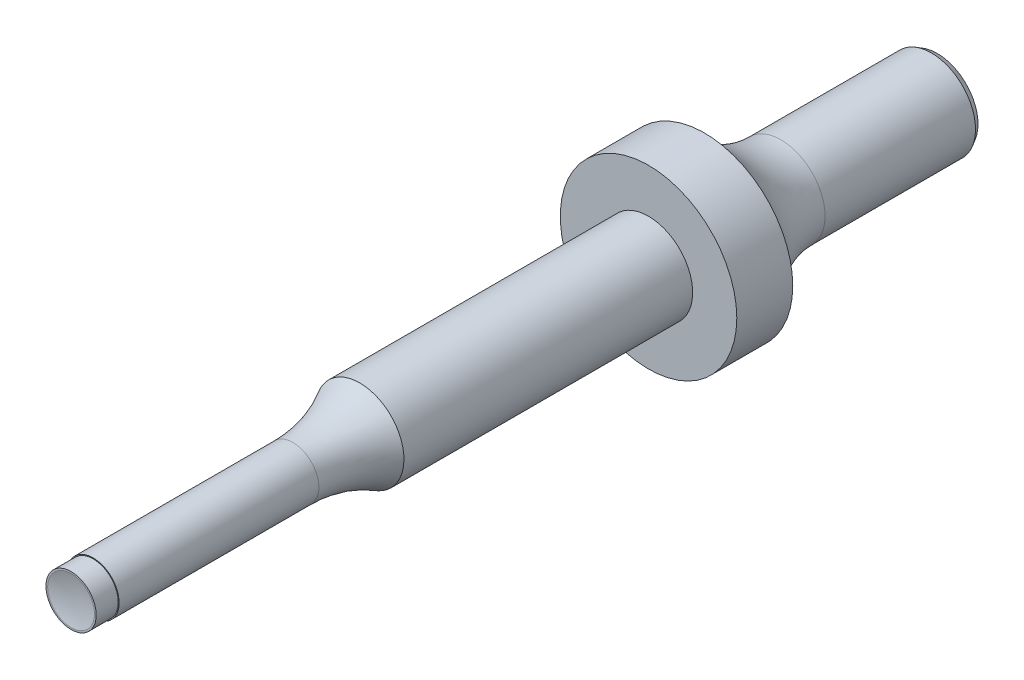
ISO-10303-21;
HEADER;
FILE_DESCRIPTION(('STEP AP214'),'2;1');
FILE_NAME('part.step','',(''),(''),'','','');
FILE_SCHEMA(('AUTOMOTIVE_DESIGN { 1 0 10303 214 1 1 1 1 }'));
ENDSEC;
DATA;
#1=APPLICATION_CONTEXT('core data for automotive mechanical design processes');
#2=APPLICATION_PROTOCOL_DEFINITION('international standard','automotive_design',2000,#1);
#3=PRODUCT_CONTEXT('',#1,'mechanical');
#4=PRODUCT('Part','Part','',(#3));
#5=PRODUCT_RELATED_PRODUCT_CATEGORY('part','',(#4));
#6=PRODUCT_DEFINITION_FORMATION('','',#4);
#7=PRODUCT_DEFINITION_CONTEXT('part definition',#1,'design');
#8=PRODUCT_DEFINITION('design','',#6,#7);
#9=PRODUCT_DEFINITION_SHAPE('','',#8);
#10=(LENGTH_UNIT() NAMED_UNIT(*) SI_UNIT(.MILLI.,.METRE.));
#11=(NAMED_UNIT(*) PLANE_ANGLE_UNIT() SI_UNIT($,.RADIAN.));
#12=(NAMED_UNIT(*) SI_UNIT($,.STERADIAN.) SOLID_ANGLE_UNIT());
#13=UNCERTAINTY_MEASURE_WITH_UNIT(LENGTH_MEASURE(1.E-05),#10,'distance_accuracy_value','');
#14=(GEOMETRIC_REPRESENTATION_CONTEXT(3) GLOBAL_UNCERTAINTY_ASSIGNED_CONTEXT((#13)) GLOBAL_UNIT_ASSIGNED_CONTEXT((#10,
#11,#12)) REPRESENTATION_CONTEXT('',''));
#15=CARTESIAN_POINT('',(0.,0.,0.));
#16=DIRECTION('',(0.,0.,1.));
#17=DIRECTION('',(1.,0.,0.));
#18=AXIS2_PLACEMENT_3D('',#15,#16,#17);
#19=CARTESIAN_POINT('',(0.,0.,-100.));
#20=DIRECTION('',(0.,0.,1.));
#21=DIRECTION('',(1.,0.,0.));
#22=AXIS2_PLACEMENT_3D('',#19,#20,#21);
#23=CYLINDRICAL_SURFACE('',#22,5.095);
#24=CARTESIAN_POINT('',(0.,0.,-33.3333333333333));
#25=DIRECTION('',(0.,0.,-1.));
#26=DIRECTION('',(0.,1.,0.));
#27=AXIS2_PLACEMENT_3D('',#24,#25,#26);
#28=CIRCLE('',#27,5.095);
#29=CARTESIAN_POINT('',(0.,5.095,-33.3333333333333));
#30=VERTEX_POINT('',#29);
#31=EDGE_CURVE('E78',#30,#30,#28,.T.);
#32=ORIENTED_EDGE('',*,*,#31,.T.);
#33=EDGE_LOOP('',(#32));
#34=FACE_BOUND('',#33,.T.);
#35=CARTESIAN_POINT('',(0.,0.,-66.6666666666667));
#36=DIRECTION('',(0.,0.,-1.));
#37=DIRECTION('',(-1.,0.,0.));
#38=AXIS2_PLACEMENT_3D('',#35,#36,#37);
#39=CIRCLE('',#38,5.095);
#40=CARTESIAN_POINT('',(-5.095,0.,-66.6666666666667));
#41=VERTEX_POINT('',#40);
#42=EDGE_CURVE('E44',#41,#41,#39,.F.);
#43=ORIENTED_EDGE('',*,*,#42,.T.);
#44=EDGE_LOOP('',(#43));
#45=FACE_BOUND('',#44,.T.);
#46=ADVANCED_FACE('F40',(#34,#45),#23,.T.);
#47=CARTESIAN_POINT('',(0.,0.,-33.3333333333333));
#48=DIRECTION('',(0.,0.,1.));
#49=DIRECTION('',(1.,0.,0.));
#50=AXIS2_PLACEMENT_3D('',#47,#48,#49);
#51=CYLINDRICAL_SURFACE('',#50,3.);
#52=CARTESIAN_POINT('',(0.,0.,-25.6096603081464));
#53=DIRECTION('',(0.,0.,1.));
#54=DIRECTION('',(0.,-1.,0.));
#55=AXIS2_PLACEMENT_3D('',#52,#53,#54);
#56=CIRCLE('',#55,3.);
#57=CARTESIAN_POINT('',(0.,-3.,-25.6096603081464));
#58=VERTEX_POINT('',#57);
#59=EDGE_CURVE('E12',#58,#58,#56,.F.);
#60=ORIENTED_EDGE('',*,*,#59,.F.);
#61=EDGE_LOOP('',(#60));
#62=FACE_BOUND('',#61,.T.);
#63=CARTESIAN_POINT('',(0.,0.,-2.5475));
#64=DIRECTION('',(0.,0.,1.));
#65=DIRECTION('',(1.,0.,0.));
#66=AXIS2_PLACEMENT_3D('',#63,#64,#65);
#67=CIRCLE('',#66,3.);
#68=CARTESIAN_POINT('',(3.,0.,-2.5475));
#69=VERTEX_POINT('',#68);
#70=EDGE_CURVE('E62',#69,#69,#67,.F.);
#71=ORIENTED_EDGE('',*,*,#70,.T.);
#72=EDGE_LOOP('',(#71));
#73=FACE_BOUND('',#72,.T.);
#74=ADVANCED_FACE('F106',(#62,#73),#51,.T.);
#75=CARTESIAN_POINT('',(0.,0.,-2.5475));
#76=DIRECTION('',(0.,0.,1.));
#77=DIRECTION('',(1.,0.,0.));
#78=AXIS2_PLACEMENT_3D('',#75,#76,#77);
#79=PLANE('',#78);
#80=ORIENTED_EDGE('',*,*,#70,.F.);
#81=EDGE_LOOP('',(#80));
#82=FACE_BOUND('',#81,.T.);
#83=CARTESIAN_POINT('',(0.,0.,-2.5475));
#84=DIRECTION('',(0.,0.,1.));
#85=DIRECTION('',(1.,0.,0.));
#86=AXIS2_PLACEMENT_3D('',#83,#84,#85);
#87=CIRCLE('',#86,2.9);
#88=CARTESIAN_POINT('',(2.9,0.,-2.5475));
#89=VERTEX_POINT('',#88);
#90=EDGE_CURVE('E66',#89,#89,#87,.T.);
#91=ORIENTED_EDGE('',*,*,#90,.F.);
#92=EDGE_LOOP('',(#91));
#93=FACE_BOUND('',#92,.T.);
#94=ADVANCED_FACE('F111',(#82,#93),#79,.T.);
#95=CARTESIAN_POINT('',(0.,0.,-2.5475));
#96=DIRECTION('',(0.,0.,1.));
#97=DIRECTION('',(1.,0.,0.));
#98=AXIS2_PLACEMENT_3D('',#95,#96,#97);
#99=CYLINDRICAL_SURFACE('',#98,2.9);
#100=CARTESIAN_POINT('',(0.,0.,0.));
#101=DIRECTION('',(0.,0.,1.));
#102=DIRECTION('',(1.,0.,0.));
#103=AXIS2_PLACEMENT_3D('',#100,#101,#102);
#104=CIRCLE('',#103,2.9);
#105=CARTESIAN_POINT('',(2.9,0.,0.));
#106=VERTEX_POINT('',#105);
#107=EDGE_CURVE('E67',#106,#106,#104,.T.);
#108=CARTESIAN_POINT('',(2.9,0.,-2.5475));
#109=CARTESIAN_POINT('',(2.9,0.,-2.52096354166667));
#110=CARTESIAN_POINT('',(2.9,0.,-2.49442708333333));
#111=CARTESIAN_POINT('',(2.9,0.,-2.44135416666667));
#112=CARTESIAN_POINT('',(2.9,0.,-2.41481770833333));
#113=CARTESIAN_POINT('',(2.9,0.,-2.36174479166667));
#114=CARTESIAN_POINT('',(2.9,0.,-2.33520833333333));
#115=CARTESIAN_POINT('',(2.9,0.,-2.28213541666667));
#116=CARTESIAN_POINT('',(2.9,0.,-2.25559895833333));
#117=CARTESIAN_POINT('',(2.9,0.,-2.20252604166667));
#118=CARTESIAN_POINT('',(2.9,0.,-2.17598958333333));
#119=CARTESIAN_POINT('',(2.9,0.,-2.12291666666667));
#120=CARTESIAN_POINT('',(2.9,0.,-2.09638020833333));
#121=CARTESIAN_POINT('',(2.9,0.,-2.04330729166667));
#122=CARTESIAN_POINT('',(2.9,0.,-2.01677083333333));
#123=CARTESIAN_POINT('',(2.9,0.,-1.96369791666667));
#124=CARTESIAN_POINT('',(2.9,0.,-1.93716145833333));
#125=CARTESIAN_POINT('',(2.9,0.,-1.88408854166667));
#126=CARTESIAN_POINT('',(2.9,0.,-1.85755208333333));
#127=CARTESIAN_POINT('',(2.9,0.,-1.80447916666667));
#128=CARTESIAN_POINT('',(2.9,0.,-1.77794270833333));
#129=CARTESIAN_POINT('',(2.9,0.,-1.72486979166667));
#130=CARTESIAN_POINT('',(2.9,0.,-1.69833333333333));
#131=CARTESIAN_POINT('',(2.9,0.,-1.64526041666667));
#132=CARTESIAN_POINT('',(2.9,0.,-1.61872395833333));
#133=CARTESIAN_POINT('',(2.9,0.,-1.56565104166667));
#134=CARTESIAN_POINT('',(2.9,0.,-1.53911458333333));
#135=CARTESIAN_POINT('',(2.9,0.,-1.48604166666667));
#136=CARTESIAN_POINT('',(2.9,0.,-1.45950520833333));
#137=CARTESIAN_POINT('',(2.9,0.,-1.40643229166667));
#138=CARTESIAN_POINT('',(2.9,0.,-1.37989583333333));
#139=CARTESIAN_POINT('',(2.9,0.,-1.32682291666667));
#140=CARTESIAN_POINT('',(2.9,0.,-1.30028645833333));
#141=CARTESIAN_POINT('',(2.9,0.,-1.24721354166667));
#142=CARTESIAN_POINT('',(2.9,0.,-1.22067708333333));
#143=CARTESIAN_POINT('',(2.9,0.,-1.16760416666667));
#144=CARTESIAN_POINT('',(2.9,0.,-1.14106770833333));
#145=CARTESIAN_POINT('',(2.9,0.,-1.08799479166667));
#146=CARTESIAN_POINT('',(2.9,0.,-1.06145833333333));
#147=CARTESIAN_POINT('',(2.9,0.,-1.00838541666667));
#148=CARTESIAN_POINT('',(2.9,0.,-0.981848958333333));
#149=CARTESIAN_POINT('',(2.9,0.,-0.928776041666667));
#150=CARTESIAN_POINT('',(2.9,0.,-0.902239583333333));
#151=CARTESIAN_POINT('',(2.9,0.,-0.849166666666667));
#152=CARTESIAN_POINT('',(2.9,0.,-0.822630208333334));
#153=CARTESIAN_POINT('',(2.9,0.,-0.769557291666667));
#154=CARTESIAN_POINT('',(2.9,0.,-0.743020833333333));
#155=CARTESIAN_POINT('',(2.9,0.,-0.689947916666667));
#156=CARTESIAN_POINT('',(2.9,0.,-0.663411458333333));
#157=CARTESIAN_POINT('',(2.9,0.,-0.610338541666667));
#158=CARTESIAN_POINT('',(2.9,0.,-0.583802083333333));
#159=CARTESIAN_POINT('',(2.9,0.,-0.530729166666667));
#160=CARTESIAN_POINT('',(2.9,0.,-0.504192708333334));
#161=CARTESIAN_POINT('',(2.9,0.,-0.451119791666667));
#162=CARTESIAN_POINT('',(2.9,0.,-0.424583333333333));
#163=CARTESIAN_POINT('',(2.9,0.,-0.371510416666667));
#164=CARTESIAN_POINT('',(2.9,0.,-0.344973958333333));
#165=CARTESIAN_POINT('',(2.9,0.,-0.291901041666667));
#166=CARTESIAN_POINT('',(2.9,0.,-0.265364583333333));
#167=CARTESIAN_POINT('',(2.9,0.,-0.212291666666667));
#168=CARTESIAN_POINT('',(2.9,0.,-0.185755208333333));
#169=CARTESIAN_POINT('',(2.9,0.,-0.132682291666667));
#170=CARTESIAN_POINT('',(2.9,0.,-0.106145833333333));
#171=CARTESIAN_POINT('',(2.9,0.,-0.0530729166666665));
#172=CARTESIAN_POINT('',(2.9,0.,-0.0265364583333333));
#173=CARTESIAN_POINT('',(2.9,0.,0.));
#174=B_SPLINE_CURVE_WITH_KNOTS('',3,(#108,#109,#110,#111,#112,#113,#114,#115,#116,#117,#118,
#119,#120,#121,#122,#123,#124,#125,#126,#127,#128,#129,#130,#131,#132,#133,#134,#135,#136,#137,
#138,#139,#140,#141,#142,#143,#144,#145,#146,#147,#148,#149,#150,#151,#152,#153,#154,#155,#156,
#157,#158,#159,#160,#161,#162,#163,#164,#165,#166,#167,#168,#169,#170,#171,#172,#173),
.UNSPECIFIED.,.F.,.F.,(4,2,2,2,2,2,2,2,2,2,2,2,2,2,2,2,2,2,2,2,2,2,2,2,2,2,2,2,2,2,2,2,4),(0.,
0.0796093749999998,0.15921875,0.238828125,0.3184375,0.398046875,0.47765625,0.557265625,0.636875,
0.716484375,0.79609375,0.875703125,0.9553125,1.034921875,1.11453125,1.194140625,1.27375,
1.353359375,1.43296875,1.512578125,1.5921875,1.671796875,1.75140625,1.831015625,1.910625,
1.990234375,2.06984375,2.149453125,2.2290625,2.308671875,2.38828125,2.467890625,2.5475),.UNSPECIFIED.);
#175=EDGE_CURVE('BSEAM147',#89,#106,#174,.T.);
#176=ORIENTED_EDGE('',*,*,#90,.T.);
#177=ORIENTED_EDGE('',*,*,#107,.F.);
#178=ORIENTED_EDGE('',*,*,#175,.T.);
#179=ORIENTED_EDGE('',*,*,#175,.F.);
#180=EDGE_LOOP('',(#176,#178,#177,#179));
#181=FACE_BOUND('',#180,.T.);
#182=ADVANCED_FACE('F147',(#181),#99,.T.);
#183=CARTESIAN_POINT('',(0.,0.,0.));
#184=DIRECTION('',(0.,0.,1.));
#185=DIRECTION('',(1.,0.,0.));
#186=AXIS2_PLACEMENT_3D('',#183,#184,#185);
#187=PLANE('',#186);
#188=CARTESIAN_POINT('',(0.,0.,0.));
#189=DIRECTION('',(0.,0.,1.));
#190=DIRECTION('',(0.,-1.,0.));
#191=AXIS2_PLACEMENT_3D('',#188,#189,#190);
#192=CIRCLE('',#191,2.7);
#193=CARTESIAN_POINT('',(0.,-2.7,0.));
#194=VERTEX_POINT('',#193);
#195=EDGE_CURVE('E71',#194,#194,#192,.T.);
#196=ORIENTED_EDGE('',*,*,#195,.F.);
#197=EDGE_LOOP('',(#196));
#198=FACE_BOUND('',#197,.T.);
#199=ORIENTED_EDGE('',*,*,#107,.T.);
#200=EDGE_LOOP('',(#199));
#201=FACE_BOUND('',#200,.T.);
#202=ADVANCED_FACE('F145',(#198,#201),#187,.T.);
#203=CARTESIAN_POINT('',(0.,0.,9.82578750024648));
#204=DIRECTION('',(0.,0.,1.));
#205=DIRECTION('',(0.,-1.,0.));
#206=AXIS2_PLACEMENT_3D('',#203,#204,#205);
#207=SPHERICAL_SURFACE('',#206,10.19);
#208=ORIENTED_EDGE('',*,*,#195,.T.);
#209=EDGE_LOOP('',(#208));
#210=FACE_BOUND('',#209,.T.);
#211=ADVANCED_FACE('F142',(#210),#207,.F.);
#212=CARTESIAN_POINT('',(0.,0.,-25.6096603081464));
#213=DIRECTION('',(0.,0.,-1.));
#214=DIRECTION('',(0.,1.,0.));
#215=AXIS2_PLACEMENT_3D('',#212,#213,#214);
#216=TOROIDAL_SURFACE('',#215,18.285,15.285);
#217=ORIENTED_EDGE('',*,*,#59,.T.);
#218=EDGE_LOOP('',(#217));
#219=FACE_BOUND('',#218,.T.);
#220=ORIENTED_EDGE('',*,*,#31,.F.);
#221=EDGE_LOOP('',(#220));
#222=FACE_BOUND('',#221,.T.);
#223=ADVANCED_FACE('F123',(#219,#222),#216,.F.);
#224=CARTESIAN_POINT('',(0.,0.,-66.6666666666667));
#225=DIRECTION('',(0.,0.,-1.));
#226=DIRECTION('',(-1.,0.,0.));
#227=AXIS2_PLACEMENT_3D('',#224,#225,#226);
#228=PLANE('',#227);
#229=ORIENTED_EDGE('',*,*,#42,.F.);
#230=EDGE_LOOP('',(#229));
#231=FACE_BOUND('',#230,.T.);
#232=CARTESIAN_POINT('',(0.,0.,-66.6666666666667));
#233=DIRECTION('',(0.,0.,1.));
#234=DIRECTION('',(1.,0.,0.));
#235=AXIS2_PLACEMENT_3D('',#232,#233,#234);
#236=CIRCLE('',#235,10.19);
#237=CARTESIAN_POINT('',(10.19,0.,-66.6666666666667));
#238=VERTEX_POINT('',#237);
#239=EDGE_CURVE('E81',#238,#238,#236,.T.);
#240=ORIENTED_EDGE('',*,*,#239,.T.);
#241=EDGE_LOOP('',(#240));
#242=FACE_BOUND('',#241,.T.);
#243=ADVANCED_FACE('F119',(#231,#242),#228,.F.);
#244=CARTESIAN_POINT('',(0.,0.,-66.6666666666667));
#245=DIRECTION('',(0.,0.,1.));
#246=DIRECTION('',(1.,0.,0.));
#247=AXIS2_PLACEMENT_3D('',#244,#245,#246);
#248=CYLINDRICAL_SURFACE('',#247,10.19);
#249=ORIENTED_EDGE('',*,*,#239,.F.);
#250=EDGE_LOOP('',(#249));
#251=FACE_BOUND('',#250,.T.);
#252=CARTESIAN_POINT('',(0.,0.,-73.1268678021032));
#253=DIRECTION('',(0.,0.,1.));
#254=DIRECTION('',(1.,0.,0.));
#255=AXIS2_PLACEMENT_3D('',#252,#253,#254);
#256=CIRCLE('',#255,10.19);
#257=CARTESIAN_POINT('',(10.19,0.,-73.1268678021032));
#258=VERTEX_POINT('',#257);
#259=EDGE_CURVE('E84',#258,#258,#256,.T.);
#260=ORIENTED_EDGE('',*,*,#259,.T.);
#261=EDGE_LOOP('',(#260));
#262=FACE_BOUND('',#261,.T.);
#263=ADVANCED_FACE('F122',(#251,#262),#248,.T.);
#264=CARTESIAN_POINT('',(0.,0.,-81.9516666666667));
#265=DIRECTION('',(0.,0.,1.));
#266=DIRECTION('',(1.,0.,0.));
#267=AXIS2_PLACEMENT_3D('',#264,#265,#266);
#268=TOROIDAL_SURFACE('',#267,15.285,10.19);
#269=ORIENTED_EDGE('',*,*,#259,.F.);
#270=EDGE_LOOP('',(#269));
#271=FACE_BOUND('',#270,.T.);
#272=CARTESIAN_POINT('',(0.,0.,-81.9516666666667));
#273=DIRECTION('',(0.,0.,1.));
#274=DIRECTION('',(1.,0.,0.));
#275=AXIS2_PLACEMENT_3D('',#272,#273,#274);
#276=CIRCLE('',#275,5.095);
#277=CARTESIAN_POINT('',(5.095,0.,-81.9516666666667));
#278=VERTEX_POINT('',#277);
#279=EDGE_CURVE('E88',#278,#278,#276,.T.);
#280=ORIENTED_EDGE('',*,*,#279,.T.);
#281=EDGE_LOOP('',(#280));
#282=FACE_BOUND('',#281,.T.);
#283=ADVANCED_FACE('F94',(#271,#282),#268,.F.);
#284=CARTESIAN_POINT('',(0.,0.,-100.));
#285=DIRECTION('',(0.,0.,1.));
#286=DIRECTION('',(1.,0.,0.));
#287=AXIS2_PLACEMENT_3D('',#284,#285,#286);
#288=PLANE('',#287);
#289=CARTESIAN_POINT('',(0.,0.,-100.));
#290=DIRECTION('',(0.,0.,1.));
#291=DIRECTION('',(1.,0.,0.));
#292=AXIS2_PLACEMENT_3D('',#289,#290,#291);
#293=CIRCLE('',#292,4.70278671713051);
#294=CARTESIAN_POINT('',(4.70278671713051,0.,-100.));
#295=VERTEX_POINT('',#294);
#296=EDGE_CURVE('E49',#295,#295,#293,.F.);
#297=ORIENTED_EDGE('',*,*,#296,.T.);
#298=EDGE_LOOP('',(#297));
#299=FACE_BOUND('',#298,.T.);
#300=ADVANCED_FACE('F102',(#299),#288,.F.);
#301=CARTESIAN_POINT('',(0.,0.,-99.3206666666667));
#302=DIRECTION('',(0.,0.,1.));
#303=DIRECTION('',(1.,0.,0.));
#304=AXIS2_PLACEMENT_3D('',#301,#302,#303);
#305=CONICAL_SURFACE('',#304,5.095,0.523598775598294);
#306=ORIENTED_EDGE('',*,*,#296,.F.);
#307=EDGE_LOOP('',(#306));
#308=FACE_BOUND('',#307,.T.);
#309=CARTESIAN_POINT('',(0.,0.,-99.3206666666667));
#310=DIRECTION('',(0.,0.,1.));
#311=DIRECTION('',(1.,0.,0.));
#312=AXIS2_PLACEMENT_3D('',#309,#310,#311);
#313=CIRCLE('',#312,5.095);
#314=CARTESIAN_POINT('',(5.095,0.,-99.3206666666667));
#315=VERTEX_POINT('',#314);
#316=EDGE_CURVE('E56',#315,#315,#313,.T.);
#317=ORIENTED_EDGE('',*,*,#316,.F.);
#318=EDGE_LOOP('',(#317));
#319=FACE_BOUND('',#318,.T.);
#320=ADVANCED_FACE('F42',(#308,#319),#305,.T.);
#321=ORIENTED_EDGE('',*,*,#316,.T.);
#322=EDGE_LOOP('',(#321));
#323=FACE_BOUND('',#322,.T.);
#324=ORIENTED_EDGE('',*,*,#279,.F.);
#325=EDGE_LOOP('',(#324));
#326=FACE_BOUND('',#325,.T.);
#327=ADVANCED_FACE('F96',(#323,#326),#23,.T.);
#328=CLOSED_SHELL('',(#46,#74,#94,#182,#202,#211,#223,#243,#263,#283,#300,#320,#327));
#329=MANIFOLD_SOLID_BREP('B2',#328);
#330=ADVANCED_BREP_SHAPE_REPRESENTATION('',(#18,#329),#14);
#331=SHAPE_DEFINITION_REPRESENTATION(#9,#330);
ENDSEC;
END-ISO-10303-21;
